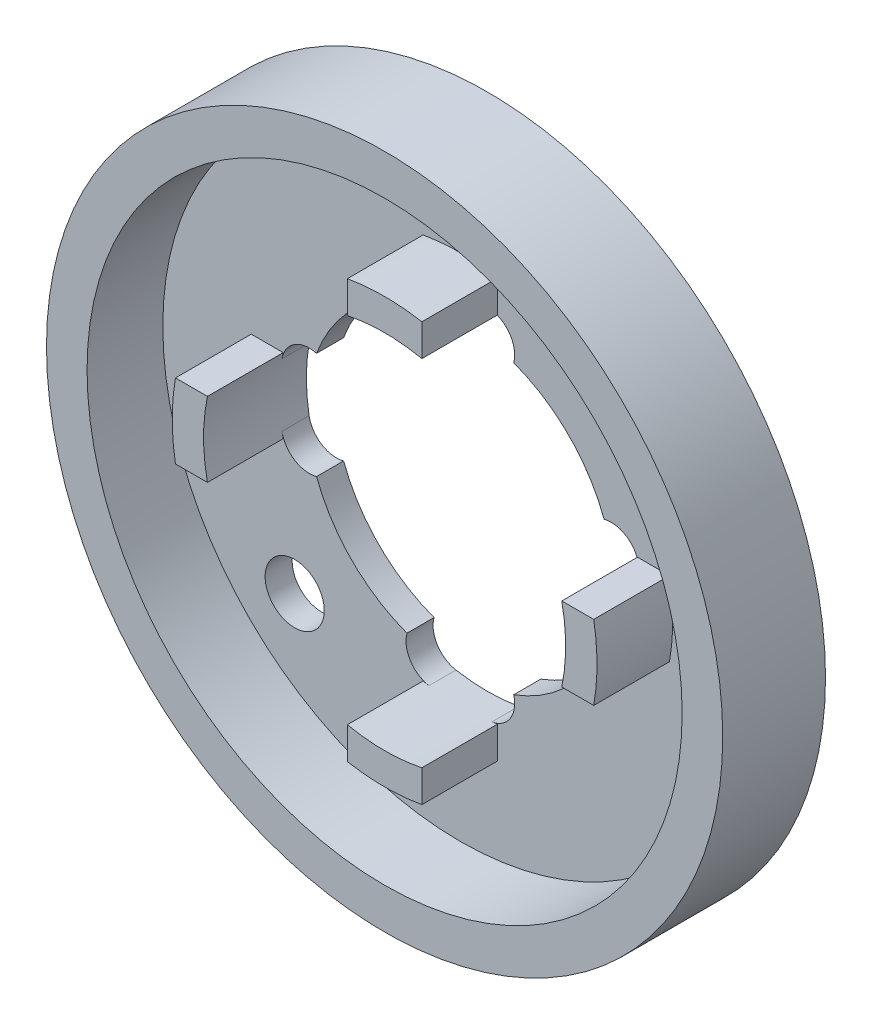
from build123d import *

# Parameters (mm, degrees)
SKETCH1_R                       = 15.875
BOSS_EXTRUDE1_DEPTH             = 4.826
CUT_EXTRUDE1_REACH              = 24.963
SKETCH3_R                       = 7.2
SKETCH4_W                       = 6.97
SKETCH4_H                       = 3.556
BOSS_EXTRUDE2_DEPTH             = 3.556
CUT_EXTRUDE2_REACH              = 24.731
CIRPATTERN1_COUNT               = 4
F_7_64_0_10938_DIAMETER_HOLE1_D = 2.778252


with BuildPart() as part:
    # Sketch1 → Boss-Extrude1 (new body)
    with BuildSketch(Plane.XY):
        Circle(SKETCH1_R)
    extrude(amount=BOSS_EXTRUDE1_DEPTH)

    # Sketch3 → Cut-Extrude1 (cut, up to next)
    with BuildSketch(Plane.XY.offset(4.826), mode=Mode.PRIVATE) as cut_extrude1_sk1:
        Circle(SKETCH3_R)
    cut_extrude1_tool1 = extrude(cut_extrude1_sk1.sketch, amount=-CUT_EXTRUDE1_REACH, mode=Mode.PRIVATE) & part.part
    add(cut_extrude1_tool1.solids().sort_by_distance((0, 0, 4.826))[0], mode=Mode.SUBTRACT)

    # Sketch4 → Cut-Revolve1 (revolve, cut)
    with BuildSketch(Plane(origin=(0, 0, 0), x_dir=(1, 0, 0), z_dir=(0, 1, 0)), mode=Mode.PRIVATE) as cut_revolve1_sk:
        with Locations((-10.485, -3.048)):
            Rectangle(SKETCH4_W, SKETCH4_H)
    revolve(cut_revolve1_sk.sketch.rotate(Axis((0, 0, 0), (0, 0, 1)), 180), axis=Axis((0, 0, 0), (0, 0, 1)), mode=Mode.SUBTRACT)

    # Sketch6 → Boss-Extrude2 (add)
    with BuildSketch(Plane.XY.offset(1.27)):
        with BuildLine():
            Line((-8.31790238, 1.75), (-9.81790238, 1.75))
            ThreePointArc((-9.81790238, 1.75), (-9.97264795, 0), (-9.81790238, -1.75))
            Line((-9.81790238, -1.75), (-8.31790238, -1.75))
            ThreePointArc((-8.31790238, -1.75), (-8.5, 0), (-8.31790238, 1.75))
        make_face()
    boss_extrude2 = extrude(amount=BOSS_EXTRUDE2_DEPTH)

    # Sketch7 → Cut-Extrude2 (cut, up to next)
    with BuildSketch(Plane.XY.offset(1.27), mode=Mode.PRIVATE) as cut_extrude2_sk1:
        with BuildLine():
            ThreePointArc((-8.370865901, 1.47600951), (-8.5, 0), (-8.370865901, -1.47600951))
            ThreePointArc((-8.370865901, -1.47600951), (-6.864873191, -2.530516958), (-5.810365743, -1.024524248))
            ThreePointArc((-5.810365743, -1.024524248), (-5.9, 0), (-5.810365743, 1.024524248))
            ThreePointArc((-5.810365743, 1.024524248), (-6.864873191, 2.530516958), (-8.370865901, 1.47600951))
        make_face()
    cut_extrude2_tool1 = extrude(cut_extrude2_sk1.sketch, amount=-CUT_EXTRUDE2_REACH, mode=Mode.PRIVATE) & part.part
    cut_extrude2 = cut_extrude2_tool1.solids().sort_by_distance((-7.130829, 0, 1.27))[0]
    add(cut_extrude2, mode=Mode.SUBTRACT)

    # CirPattern1: Boss-Extrude2, Cut-Extrude2 ×4 about axis
    cirpattern1_axis = Axis((0, 0, 0), (0, 0, 1))
    add([boss_extrude2.rotate(cirpattern1_axis, i * 360 / CIRPATTERN1_COUNT) for i in range(1, CIRPATTERN1_COUNT)])
    add([cut_extrude2.rotate(cirpattern1_axis, i * 360 / CIRPATTERN1_COUNT) for i in range(1, CIRPATTERN1_COUNT)], mode=Mode.SUBTRACT)

    # 7_64 _0.10938_ Diameter Hole1 (through all)
    with Locations(Plane(origin=(0, 0, 0), x_dir=(-1, 0, 0), z_dir=(0, 0, -1))):
        with Locations((7.778174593, -7.778174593), (-7.778174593, 7.778174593)):
            Hole(F_7_64_0_10938_DIAMETER_HOLE1_D / 2)


solid = part.part
